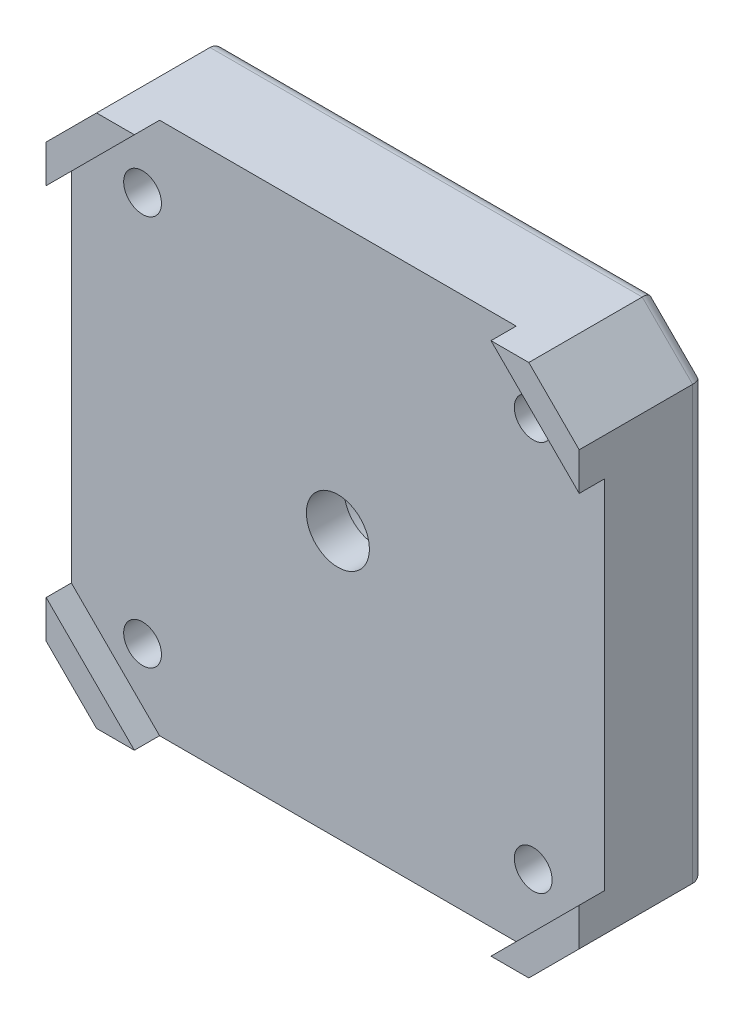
from build123d import *

# Parameters (mm, degrees)
BOSS_EXTRU_1_DEPTH      = 10
ENL_V_MAT_EXTRU_1_DEPTH = 2
ESQUISSE3_R             = 1.5
ENL_V_MAT_EXTRU_2_DEPTH = 31.96199283
ESQUISSE4_R             = 3.1
ENL_V_MAT_EXTRU_3_DEPTH = 3
CONG_1_R                = 0.5
CONG_2_R                = 1
ESQUISSE5_R             = 5.5
ENL_V_MAT_EXTRU_4_DEPTH = 5
ESQUISSE6_R             = 2.5
ENL_V_MAT_EXTRU_5_DEPTH = 31.32564921
CONG_3_R                = 0.5


with BuildPart() as part:
    # Esquisse1 → Boss.-Extru.1 (new body)
    with BuildSketch(Plane.XY):
        Polygon((-21.15, 17.15), (-17.15, 21.15), (17.15, 21.15), (21.15, 17.15), (21.15, -17.15), (17.15, -21.15), (-17.15, -21.15), (-21.15, -17.15), align=None)
    extrude(amount=BOSS_EXTRU_1_DEPTH)

    # Esquisse2 → Enl_v. mat.-Extru.1 (cut)
    with BuildSketch(Plane.XY.offset(10)):
        Polygon((14.15, 21.15), (21.15, 14.15), (21.15, -14.15), (14.15, -21.15), (-14.15, -21.15), (-21.15, -14.15), (-21.15, 14.15), (-14.15, 21.15), align=None)
    extrude(amount=-ENL_V_MAT_EXTRU_1_DEPTH, mode=Mode.SUBTRACT)

    # Esquisse3 → Enl_v. mat.-Extru.2 (cut, through all)
    with BuildSketch(Plane.XY.offset(8)):
        with Locations((-15.5, 15.5)):
            Circle(ESQUISSE3_R)
        with Locations((15.5, 15.5)):
            Circle(ESQUISSE3_R)
        with Locations((15.5, -15.5)):
            Circle(ESQUISSE3_R)
        with Locations((-15.5, -15.5)):
            Circle(ESQUISSE3_R)
    extrude(amount=-ENL_V_MAT_EXTRU_2_DEPTH, mode=Mode.SUBTRACT)

    # Esquisse4 → Enl_v. mat.-Extru.3 (cut)
    with BuildSketch(Plane(origin=(0, 0, 0), x_dir=(-1, 0, 0), z_dir=(0, 0, -1))):
        with Locations((-15.5, 15.5)):
            Circle(ESQUISSE4_R)
        with Locations((15.5, 15.5)):
            Circle(ESQUISSE4_R)
        with Locations((15.5, -15.5)):
            Circle(ESQUISSE4_R)
        with Locations((-15.5, -15.5)):
            Circle(ESQUISSE4_R)
    extrude(amount=-ENL_V_MAT_EXTRU_3_DEPTH, mode=Mode.SUBTRACT)

    # Cong_1
    cong_1_edges = [part.edges().sort_by_distance(p)[0] for p in [
        (18.6, -15.5, 0),
        (18.6, -15.5, 3),
        (-12.4, -15.5, 0),
        (-12.4, -15.5, 3),
        (-12.4, 15.5, 0),
        (-12.4, 15.5, 3),
        (18.6, 15.5, 0),
        (18.6, 15.5, 3),
    ]]
    fillet(cong_1_edges, radius=CONG_1_R)

    # Cong_2
    cong_2_edges = [part.edges().sort_by_distance(p)[0] for p in [
        (-19.15, -19.15, 0),
        (-21.15, 0, 0),
        (-19.15, 19.15, 0),
        (0, 21.15, 0),
        (19.15, 19.15, 0),
        (21.15, 0, 0),
        (19.15, -19.15, 0),
        (0, -21.15, 0),
    ]]
    fillet(cong_2_edges, radius=CONG_2_R)

    # Esquisse5 → Enl_v. mat.-Extru.4 (cut)
    with BuildSketch(Plane(origin=(0, 0, 0), x_dir=(-1, 0, 0), z_dir=(0, 0, -1))):
        Circle(ESQUISSE5_R)
    extrude(amount=-ENL_V_MAT_EXTRU_4_DEPTH, mode=Mode.SUBTRACT)

    # Esquisse6 → Enl_v. mat.-Extru.5 (cut, through all)
    with BuildSketch(Plane(origin=(0, 0, 5), x_dir=(-1, 0, 0), z_dir=(0, 0, -1))):
        Circle(ESQUISSE6_R)
    extrude(amount=-ENL_V_MAT_EXTRU_5_DEPTH, mode=Mode.SUBTRACT)

    # Cong_3
    cong_3_edges = [part.edges().sort_by_distance(p)[0] for p in [
        (5.5, 0, 5),
        (5.5, 0, 0),
    ]]
    fillet(cong_3_edges, radius=CONG_3_R)


solid = part.part
